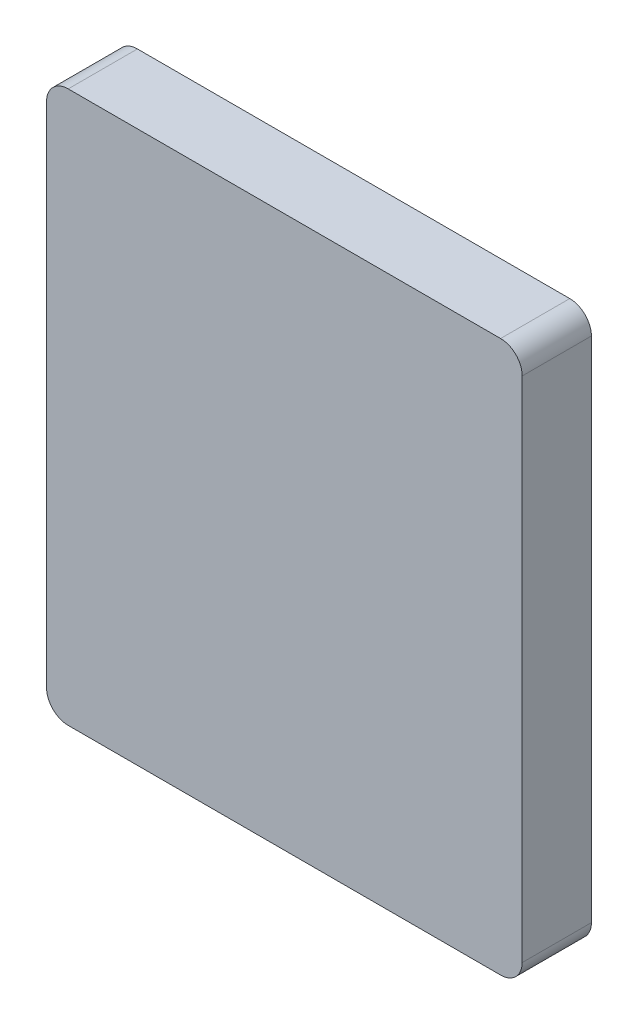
from build123d import *

# Parameters (mm, degrees)
SKETCH1_W           = 55.88
SKETCH1_H           = 64.77
BOSS_EXTRUDE1_DEPTH = 8.128
FILLET1_R           = 2.54


with BuildPart() as part:
    # Sketch1 → Boss-Extrude1 (new body)
    with BuildSketch(Plane.XY):
        with Locations((27.94, 32.385)):
            Rectangle(SKETCH1_W, SKETCH1_H)
    extrude(amount=BOSS_EXTRUDE1_DEPTH)

    # Fillet1
    fillet1_edges = [part.edges().sort_by_distance(p)[0] for p in [
        (0, 64.77, 4.064),
        (55.88, 64.77, 4.064),
        (55.88, 0, 4.064),
        (0, 0, 4.064),
    ]]
    fillet(fillet1_edges, radius=FILLET1_R)


solid = part.part
